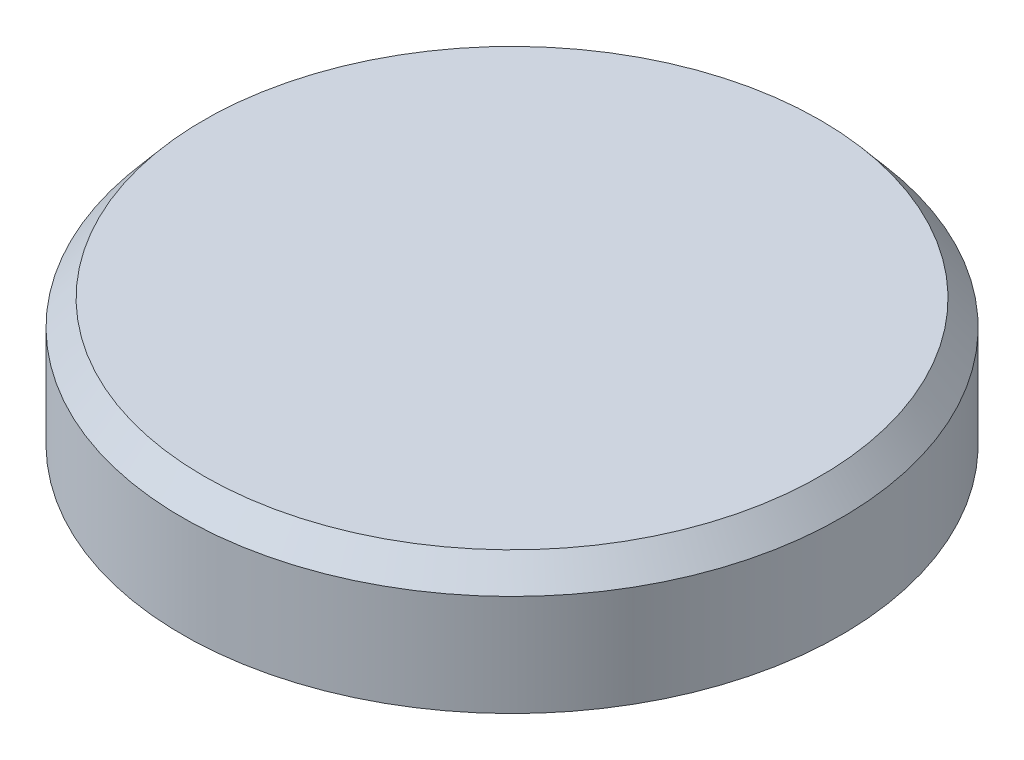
ISO-10303-21;
HEADER;
FILE_DESCRIPTION(('STEP AP214'),'2;1');
FILE_NAME('part.step','',(''),(''),'','','');
FILE_SCHEMA(('AUTOMOTIVE_DESIGN { 1 0 10303 214 1 1 1 1 }'));
ENDSEC;
DATA;
#1=APPLICATION_CONTEXT('core data for automotive mechanical design processes');
#2=APPLICATION_PROTOCOL_DEFINITION('international standard','automotive_design',2000,#1);
#3=PRODUCT_CONTEXT('',#1,'mechanical');
#4=PRODUCT('Part','Part','',(#3));
#5=PRODUCT_RELATED_PRODUCT_CATEGORY('part','',(#4));
#6=PRODUCT_DEFINITION_FORMATION('','',#4);
#7=PRODUCT_DEFINITION_CONTEXT('part definition',#1,'design');
#8=PRODUCT_DEFINITION('design','',#6,#7);
#9=PRODUCT_DEFINITION_SHAPE('','',#8);
#10=(LENGTH_UNIT() NAMED_UNIT(*) SI_UNIT(.MILLI.,.METRE.));
#11=(NAMED_UNIT(*) PLANE_ANGLE_UNIT() SI_UNIT($,.RADIAN.));
#12=(NAMED_UNIT(*) SI_UNIT($,.STERADIAN.) SOLID_ANGLE_UNIT());
#13=UNCERTAINTY_MEASURE_WITH_UNIT(LENGTH_MEASURE(1.E-05),#10,'distance_accuracy_value','');
#14=(GEOMETRIC_REPRESENTATION_CONTEXT(3) GLOBAL_UNCERTAINTY_ASSIGNED_CONTEXT((#13)) GLOBAL_UNIT_ASSIGNED_CONTEXT((#10,
#11,#12)) REPRESENTATION_CONTEXT('',''));
#15=CARTESIAN_POINT('',(0.,0.,0.));
#16=DIRECTION('',(0.,0.,1.));
#17=DIRECTION('',(1.,0.,0.));
#18=AXIS2_PLACEMENT_3D('',#15,#16,#17);
#19=CARTESIAN_POINT('',(0.,-1281.,0.));
#20=DIRECTION('',(0.,-1.,0.));
#21=DIRECTION('',(0.,0.,-1.));
#22=AXIS2_PLACEMENT_3D('',#19,#20,#21);
#23=PLANE('',#22);
#24=CARTESIAN_POINT('',(0.,-1281.,0.));
#25=DIRECTION('',(0.,-1.,0.));
#26=DIRECTION('',(0.,0.,-1.));
#27=AXIS2_PLACEMENT_3D('',#24,#25,#26);
#28=CIRCLE('',#27,409.949820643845);
#29=CARTESIAN_POINT('',(0.,-1281.,-409.949820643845));
#30=VERTEX_POINT('',#29);
#31=EDGE_CURVE('E9',#30,#30,#28,.T.);
#32=ORIENTED_EDGE('',*,*,#31,.T.);
#33=EDGE_LOOP('',(#32));
#34=FACE_BOUND('',#33,.T.);
#35=ADVANCED_FACE('F14',(#34),#23,.T.);
#36=CARTESIAN_POINT('',(0.,-1281.,0.));
#37=DIRECTION('',(0.,1.,0.));
#38=DIRECTION('',(0.,0.,1.));
#39=AXIS2_PLACEMENT_3D('',#36,#37,#38);
#40=CONICAL_SURFACE('',#39,409.949820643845,1.01229096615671);
#41=CARTESIAN_POINT('',(0.,-1131.,0.));
#42=DIRECTION('',(0.,-1.,0.));
#43=DIRECTION('',(0.,0.,-1.));
#44=AXIS2_PLACEMENT_3D('',#41,#42,#43);
#45=CIRCLE('',#44,650.);
#46=CARTESIAN_POINT('',(0.,-1131.,-650.));
#47=VERTEX_POINT('',#46);
#48=EDGE_CURVE('E20',#47,#47,#45,.T.);
#49=ORIENTED_EDGE('',*,*,#48,.T.);
#50=EDGE_LOOP('',(#49));
#51=FACE_BOUND('',#50,.T.);
#52=ORIENTED_EDGE('',*,*,#31,.F.);
#53=EDGE_LOOP('',(#52));
#54=FACE_BOUND('',#53,.T.);
#55=ADVANCED_FACE('F47',(#51,#54),#40,.T.);
#56=CARTESIAN_POINT('',(0.,-1281.,0.));
#57=DIRECTION('',(0.,-1.,0.));
#58=DIRECTION('',(0.,0.,-1.));
#59=AXIS2_PLACEMENT_3D('',#56,#57,#58);
#60=CYLINDRICAL_SURFACE('',#59,650.);
#61=CARTESIAN_POINT('',(0.,-931.,0.));
#62=DIRECTION('',(0.,-1.,0.));
#63=DIRECTION('',(0.,0.,-1.));
#64=AXIS2_PLACEMENT_3D('',#61,#62,#63);
#65=CIRCLE('',#64,650.);
#66=CARTESIAN_POINT('',(0.,-931.,-650.));
#67=VERTEX_POINT('',#66);
#68=EDGE_CURVE('E24',#67,#67,#65,.T.);
#69=ORIENTED_EDGE('',*,*,#68,.T.);
#70=EDGE_LOOP('',(#69));
#71=FACE_BOUND('',#70,.T.);
#72=ORIENTED_EDGE('',*,*,#48,.F.);
#73=EDGE_LOOP('',(#72));
#74=FACE_BOUND('',#73,.T.);
#75=ADVANCED_FACE('F44',(#71,#74),#60,.T.);
#76=CARTESIAN_POINT('',(0.,-931.,0.));
#77=DIRECTION('',(0.,-1.,0.));
#78=DIRECTION('',(0.,0.,-1.));
#79=AXIS2_PLACEMENT_3D('',#76,#77,#78);
#80=CONICAL_SURFACE('',#79,650.,0.698131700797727);
#81=CARTESIAN_POINT('',(0.,-881.,0.));
#82=DIRECTION('',(0.,-1.,0.));
#83=DIRECTION('',(0.,0.,-1.));
#84=AXIS2_PLACEMENT_3D('',#81,#82,#83);
#85=CIRCLE('',#84,608.045018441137);
#86=CARTESIAN_POINT('',(0.,-881.,-608.045018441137));
#87=VERTEX_POINT('',#86);
#88=EDGE_CURVE('E28',#87,#87,#85,.T.);
#89=ORIENTED_EDGE('',*,*,#88,.T.);
#90=EDGE_LOOP('',(#89));
#91=FACE_BOUND('',#90,.T.);
#92=ORIENTED_EDGE('',*,*,#68,.F.);
#93=EDGE_LOOP('',(#92));
#94=FACE_BOUND('',#93,.T.);
#95=ADVANCED_FACE('F34',(#91,#94),#80,.T.);
#96=CARTESIAN_POINT('',(608.045018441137,-881.,0.));
#97=DIRECTION('',(0.,1.,0.));
#98=DIRECTION('',(0.,0.,1.));
#99=AXIS2_PLACEMENT_3D('',#96,#97,#98);
#100=PLANE('',#99);
#101=ORIENTED_EDGE('',*,*,#88,.F.);
#102=EDGE_LOOP('',(#101));
#103=FACE_BOUND('',#102,.T.);
#104=ADVANCED_FACE('F37',(#103),#100,.T.);
#105=CLOSED_SHELL('',(#35,#55,#75,#95,#104));
#106=MANIFOLD_SOLID_BREP('B1',#105);
#107=ADVANCED_BREP_SHAPE_REPRESENTATION('',(#18,#106),#14);
#108=SHAPE_DEFINITION_REPRESENTATION(#9,#107);
ENDSEC;
END-ISO-10303-21;
